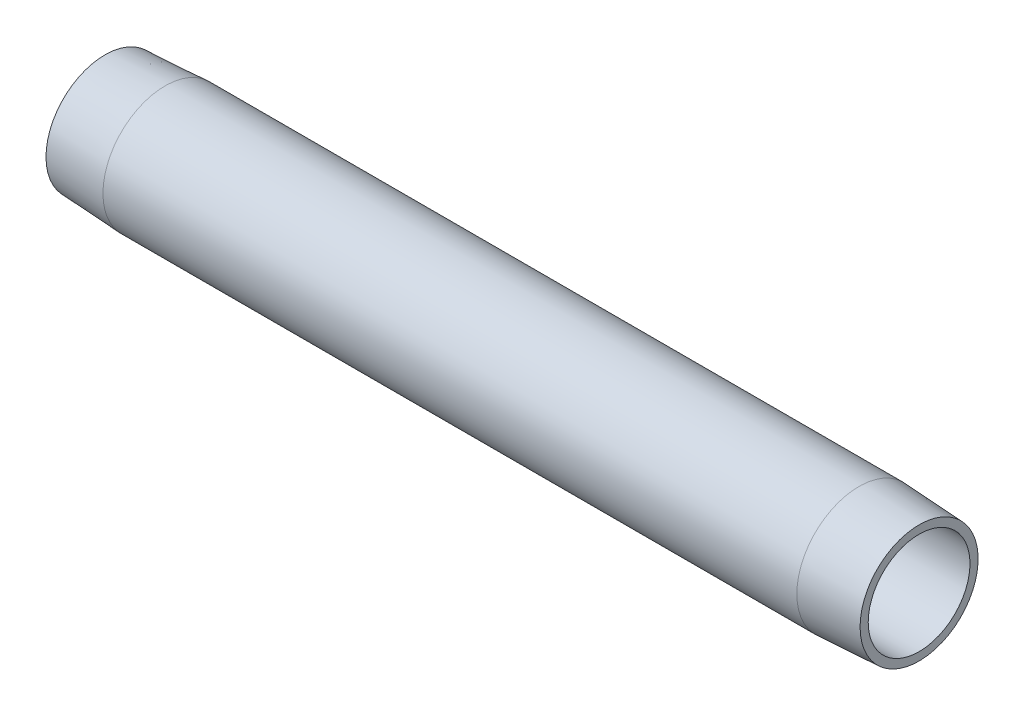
ISO-10303-21;
HEADER;
FILE_DESCRIPTION(('STEP AP214'),'2;1');
FILE_NAME('part.step','',(''),(''),'','','');
FILE_SCHEMA(('AUTOMOTIVE_DESIGN { 1 0 10303 214 1 1 1 1 }'));
ENDSEC;
DATA;
#1=APPLICATION_CONTEXT('core data for automotive mechanical design processes');
#2=APPLICATION_PROTOCOL_DEFINITION('international standard','automotive_design',2000,#1);
#3=PRODUCT_CONTEXT('',#1,'mechanical');
#4=PRODUCT('Part','Part','',(#3));
#5=PRODUCT_RELATED_PRODUCT_CATEGORY('part','',(#4));
#6=PRODUCT_DEFINITION_FORMATION('','',#4);
#7=PRODUCT_DEFINITION_CONTEXT('part definition',#1,'design');
#8=PRODUCT_DEFINITION('design','',#6,#7);
#9=PRODUCT_DEFINITION_SHAPE('','',#8);
#10=(LENGTH_UNIT() NAMED_UNIT(*) SI_UNIT(.MILLI.,.METRE.));
#11=(NAMED_UNIT(*) PLANE_ANGLE_UNIT() SI_UNIT($,.RADIAN.));
#12=(NAMED_UNIT(*) SI_UNIT($,.STERADIAN.) SOLID_ANGLE_UNIT());
#13=UNCERTAINTY_MEASURE_WITH_UNIT(LENGTH_MEASURE(1.E-05),#10,'distance_accuracy_value','');
#14=(GEOMETRIC_REPRESENTATION_CONTEXT(3) GLOBAL_UNCERTAINTY_ASSIGNED_CONTEXT((#13)) GLOBAL_UNIT_ASSIGNED_CONTEXT((#10,
#11,#12)) REPRESENTATION_CONTEXT('',''));
#15=CARTESIAN_POINT('',(0.,0.,0.));
#16=DIRECTION('',(0.,0.,1.));
#17=DIRECTION('',(1.,0.,0.));
#18=AXIS2_PLACEMENT_3D('',#15,#16,#17);
#19=CARTESIAN_POINT('',(139.7,8.73125,0.));
#20=DIRECTION('',(-1.,0.,0.));
#21=DIRECTION('',(0.,0.,1.));
#22=AXIS2_PLACEMENT_3D('',#19,#20,#21);
#23=PLANE('',#22);
#24=CARTESIAN_POINT('',(139.7,0.,0.));
#25=DIRECTION('',(-1.,0.,0.));
#26=DIRECTION('',(0.,0.,1.));
#27=AXIS2_PLACEMENT_3D('',#24,#25,#26);
#28=CIRCLE('',#27,10.1275500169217);
#29=CARTESIAN_POINT('',(139.7,0.,10.1275500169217));
#30=VERTEX_POINT('',#29);
#31=EDGE_CURVE('E10',#30,#30,#28,.T.);
#32=ORIENTED_EDGE('',*,*,#31,.F.);
#33=EDGE_LOOP('',(#32));
#34=FACE_BOUND('',#33,.T.);
#35=CARTESIAN_POINT('',(139.7,0.,0.));
#36=DIRECTION('',(-1.,0.,0.));
#37=DIRECTION('',(0.,0.,1.));
#38=AXIS2_PLACEMENT_3D('',#35,#36,#37);
#39=CIRCLE('',#38,8.73125);
#40=CARTESIAN_POINT('',(139.7,0.,8.73125));
#41=VERTEX_POINT('',#40);
#42=EDGE_CURVE('E52',#41,#41,#39,.T.);
#43=ORIENTED_EDGE('',*,*,#42,.T.);
#44=EDGE_LOOP('',(#43));
#45=FACE_BOUND('',#44,.T.);
#46=ADVANCED_FACE('F30',(#34,#45),#23,.F.);
#47=CARTESIAN_POINT('',(139.7,0.,0.));
#48=DIRECTION('',(-1.,0.,0.));
#49=DIRECTION('',(0.,0.,1.));
#50=AXIS2_PLACEMENT_3D('',#47,#48,#49);
#51=CONICAL_SURFACE('',#50,10.1275500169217,0.0523598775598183);
#52=CARTESIAN_POINT('',(129.3876,0.,0.));
#53=DIRECTION('',(-1.,0.,0.));
#54=DIRECTION('',(0.,0.,1.));
#55=AXIS2_PLACEMENT_3D('',#52,#53,#54);
#56=CIRCLE('',#55,10.668);
#57=CARTESIAN_POINT('',(129.3876,0.,10.668));
#58=VERTEX_POINT('',#57);
#59=EDGE_CURVE('E36',#58,#58,#56,.T.);
#60=ORIENTED_EDGE('',*,*,#59,.F.);
#61=EDGE_LOOP('',(#60));
#62=FACE_BOUND('',#61,.T.);
#63=ORIENTED_EDGE('',*,*,#31,.T.);
#64=EDGE_LOOP('',(#63));
#65=FACE_BOUND('',#64,.T.);
#66=ADVANCED_FACE('F77',(#62,#65),#51,.T.);
#67=CARTESIAN_POINT('',(0.,0.,0.));
#68=DIRECTION('',(-1.,0.,0.));
#69=DIRECTION('',(0.,0.,1.));
#70=AXIS2_PLACEMENT_3D('',#67,#68,#69);
#71=CYLINDRICAL_SURFACE('',#70,10.668);
#72=CARTESIAN_POINT('',(10.3124,0.,0.));
#73=DIRECTION('',(-1.,0.,0.));
#74=DIRECTION('',(0.,0.,1.));
#75=AXIS2_PLACEMENT_3D('',#72,#73,#74);
#76=CIRCLE('',#75,10.668);
#77=CARTESIAN_POINT('',(10.3124,0.,10.668));
#78=VERTEX_POINT('',#77);
#79=EDGE_CURVE('E40',#78,#78,#76,.T.);
#80=ORIENTED_EDGE('',*,*,#79,.F.);
#81=EDGE_LOOP('',(#80));
#82=FACE_BOUND('',#81,.T.);
#83=ORIENTED_EDGE('',*,*,#59,.T.);
#84=EDGE_LOOP('',(#83));
#85=FACE_BOUND('',#84,.T.);
#86=ADVANCED_FACE('F72',(#82,#85),#71,.T.);
#87=CARTESIAN_POINT('',(10.3124,0.,0.));
#88=DIRECTION('',(1.,0.,0.));
#89=DIRECTION('',(0.,0.,-1.));
#90=AXIS2_PLACEMENT_3D('',#87,#88,#89);
#91=CONICAL_SURFACE('',#90,10.668,0.0523598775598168);
#92=CARTESIAN_POINT('',(0.,0.,0.));
#93=DIRECTION('',(-1.,0.,0.));
#94=DIRECTION('',(0.,0.,1.));
#95=AXIS2_PLACEMENT_3D('',#92,#93,#94);
#96=CIRCLE('',#95,10.1275500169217);
#97=CARTESIAN_POINT('',(0.,0.,10.1275500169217));
#98=VERTEX_POINT('',#97);
#99=EDGE_CURVE('E44',#98,#98,#96,.T.);
#100=ORIENTED_EDGE('',*,*,#99,.F.);
#101=EDGE_LOOP('',(#100));
#102=FACE_BOUND('',#101,.T.);
#103=ORIENTED_EDGE('',*,*,#79,.T.);
#104=EDGE_LOOP('',(#103));
#105=FACE_BOUND('',#104,.T.);
#106=ADVANCED_FACE('F66',(#102,#105),#91,.T.);
#107=CARTESIAN_POINT('',(0.,10.1275500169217,0.));
#108=DIRECTION('',(1.,0.,0.));
#109=DIRECTION('',(0.,0.,-1.));
#110=AXIS2_PLACEMENT_3D('',#107,#108,#109);
#111=PLANE('',#110);
#112=CARTESIAN_POINT('',(0.,0.,0.));
#113=DIRECTION('',(-1.,0.,0.));
#114=DIRECTION('',(0.,0.,1.));
#115=AXIS2_PLACEMENT_3D('',#112,#113,#114);
#116=CIRCLE('',#115,8.73125);
#117=CARTESIAN_POINT('',(0.,0.,8.73125));
#118=VERTEX_POINT('',#117);
#119=EDGE_CURVE('E49',#118,#118,#116,.T.);
#120=ORIENTED_EDGE('',*,*,#119,.F.);
#121=EDGE_LOOP('',(#120));
#122=FACE_BOUND('',#121,.T.);
#123=ORIENTED_EDGE('',*,*,#99,.T.);
#124=EDGE_LOOP('',(#123));
#125=FACE_BOUND('',#124,.T.);
#126=ADVANCED_FACE('F60',(#122,#125),#111,.F.);
#127=CARTESIAN_POINT('',(0.,0.,0.));
#128=DIRECTION('',(-1.,0.,0.));
#129=DIRECTION('',(0.,0.,1.));
#130=AXIS2_PLACEMENT_3D('',#127,#128,#129);
#131=CYLINDRICAL_SURFACE('',#130,8.73125);
#132=ORIENTED_EDGE('',*,*,#42,.F.);
#133=EDGE_LOOP('',(#132));
#134=FACE_BOUND('',#133,.T.);
#135=ORIENTED_EDGE('',*,*,#119,.T.);
#136=EDGE_LOOP('',(#135));
#137=FACE_BOUND('',#136,.T.);
#138=ADVANCED_FACE('F57',(#134,#137),#131,.F.);
#139=CLOSED_SHELL('',(#46,#66,#86,#106,#126,#138));
#140=MANIFOLD_SOLID_BREP('B2',#139);
#141=ADVANCED_BREP_SHAPE_REPRESENTATION('',(#18,#140),#14);
#142=SHAPE_DEFINITION_REPRESENTATION(#9,#141);
ENDSEC;
END-ISO-10303-21;
